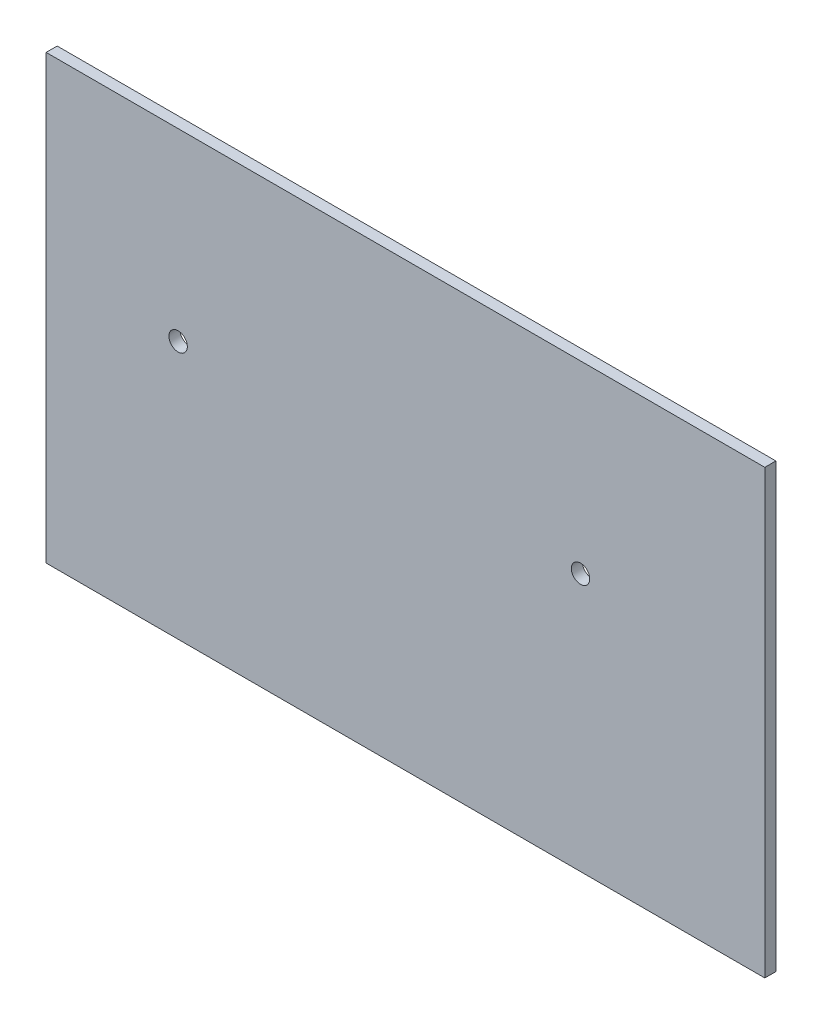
from build123d import *

# Parameters (mm, degrees)
ESQUISSE1_W             = 195
ESQUISSE1_H             = 120
EXTRUSION1_DEPTH        = 3
ESQUISSE2_R             = 2.5
ENL_V_MAT_EXTRU_1_DEPTH = 138.903574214


with BuildPart() as part:
    # Esquisse1 → Extrusion1 (new body)
    with BuildSketch(Plane.XY):
        with Locations((21.725497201, -9.236382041)):
            Rectangle(ESQUISSE1_W, ESQUISSE1_H)
    extrude(amount=EXTRUSION1_DEPTH)

    # Esquisse2 → Enl_v. mat.-Extru.1 (cut, through all)
    with BuildSketch(Plane.XY.offset(3)):
        with Locations((69.225497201, 0.763617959)):
            Circle(ESQUISSE2_R)
        with Locations((-39.96484714, 0.763617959)):
            Circle(ESQUISSE2_R)
    extrude(amount=-ENL_V_MAT_EXTRU_1_DEPTH, mode=Mode.SUBTRACT)


solid = part.part
